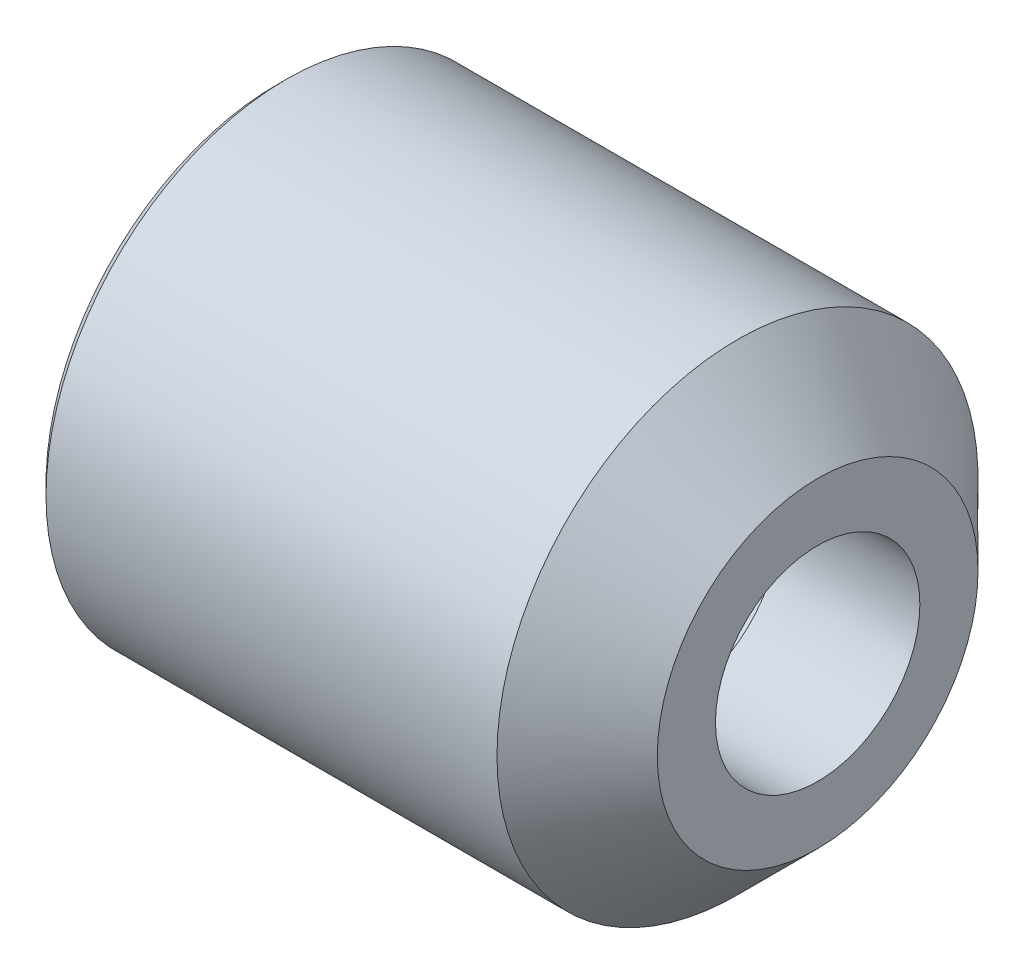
from build123d import *

# Parameters (mm, degrees)
CHANFREIN1_SIZE = 4
CHANFREIN2_SIZE = 0.5


with BuildPart() as part:
    # Esquisse1 → R_volution1 (revolve)
    with BuildSketch(Plane.XY, mode=Mode.PRIVATE) as r_volution1_sk:
        Polygon((0, 12), (27, 12), (27, 5.1), (20, 5.1), (20, 8.6), (0, 8.6), align=None)
    revolve(r_volution1_sk.sketch.rotate(Axis((-60.936740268, 0, 0), (1, 0, 0)), 90), axis=Axis((-60.936740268, 0, 0), (1, 0, 0)))

    # Chanfrein1
    chanfrein1_edges = [part.edges().sort_by_distance(p)[0] for p in [
        (27, 0, -12),
    ]]
    chamfer(chanfrein1_edges, length=CHANFREIN1_SIZE)

    # Chanfrein2
    chanfrein2_edges = [part.edges().sort_by_distance(p)[0] for p in [
        (0, 0, -12),
    ]]
    chamfer(chanfrein2_edges, length=CHANFREIN2_SIZE)


solid = part.part
